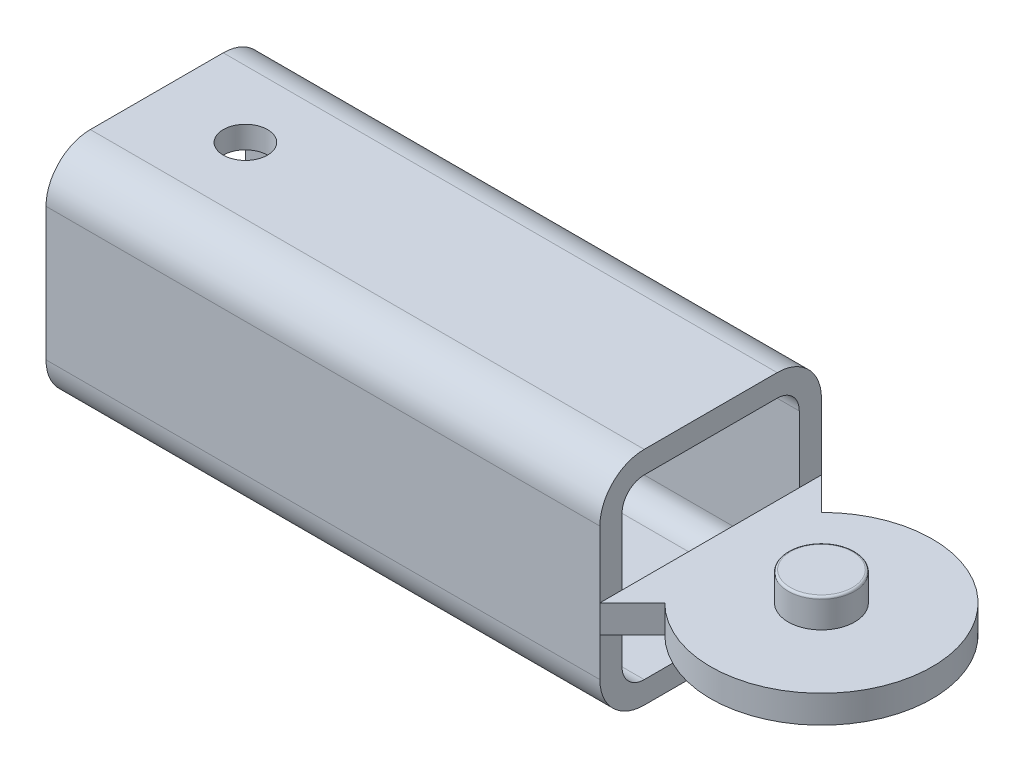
from build123d import *
from build123d.topology import SkipClean

# Parameters (mm, degrees)
SQUARE_TUBE_20_X_20_X_2_1_DEPTH = 50
SKETCH12_W                      = 20
SKETCH12_H                      = 2.5
BOSS_EXTRUDE1_DEPTH             = 20
CUT_EXTRUDE1_DEPTH              = 20
CUT_EXTRUDE2_DEPTH              = 20
SKETCH17_R                      = 3
BOSS_EXTRUDE2_DEPTH             = 2.6
FILLET2_R                       = 0.2
SKETCH18_R                      = 8
SKETCH18_R_2                    = 7
CUT_EXTRUDE4_DEPTH              = 0.2
SKETCH19_R                      = 2
CUT_EXTRUDE5_DEPTH              = 20


with BuildPart() as part:
    # Sketch11 → Square tube 20 X 20 X 2_1 (new body)
    with BuildSketch(Plane(origin=(-27.324380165, 0, 0), x_dir=(0, 0, -1), z_dir=(1, 0, 0))):
        with BuildLine():
            Line((-6, -10), (6, -10))
            ThreePointArc((6, -10), (8.828427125, -8.828427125), (10, -6))
            Line((10, -6), (10, 6))
            ThreePointArc((10, 6), (8.828427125, 8.828427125), (6, 10))
            Line((6, 10), (-6, 10))
            ThreePointArc((-6, 10), (-8.828427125, 8.828427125), (-10, 6))
            Line((-10, 6), (-10, -6))
            ThreePointArc((-10, -6), (-8.828427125, -8.828427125), (-6, -10))
        make_face()
        with BuildLine():
            Line((-6, -8), (6, -8))
            ThreePointArc((6, -8), (7.414213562, -7.414213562), (8, -6))
            Line((8, -6), (8, 6))
            ThreePointArc((8, 6), (7.414213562, 7.414213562), (6, 8))
            Line((6, 8), (-6, 8))
            ThreePointArc((-6, 8), (-7.414213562, 7.414213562), (-8, 6))
            Line((-8, 6), (-8, -6))
            ThreePointArc((-8, -6), (-7.414213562, -7.414213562), (-6, -8))
        make_face(mode=Mode.SUBTRACT)
    extrude(amount=SQUARE_TUBE_20_X_20_X_2_1_DEPTH)

    # Sketch12 → Boss-Extrude1 (add)
    with BuildSketch(Plane(origin=(22.675619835, 0, 0), x_dir=(0, 0, -1), z_dir=(1, 0, 0))):
        with Locations((0, -1.25)):
            Rectangle(SKETCH12_W, SKETCH12_H)
    extrude(amount=BOSS_EXTRUDE1_DEPTH)

    # Sketch15 → Cut-Extrude1 (cut)
    with BuildSketch(Plane(origin=(0, 0, 0), x_dir=(1, 0, 0), z_dir=(0, 1, 0))):
        with BuildLine():
            Line((42.675619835, -10), (42.675619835, 0))
            ThreePointArc((42.675619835, 0), (39.746687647, -7.071067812), (32.675619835, -10))
            Line((32.675619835, -10), (42.675619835, -10))
        make_face()
        with BuildLine():
            Line((42.675619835, 10), (32.675619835, 10))
            ThreePointArc((32.675619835, 10), (39.746687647, 7.071067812), (42.675619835, 0))
            Line((42.675619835, 0), (42.675619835, 10))
        make_face()
    extrude(amount=-CUT_EXTRUDE1_DEPTH, mode=Mode.SUBTRACT)

    # Sketch16 → Cut-Extrude2 (cut)
    with SkipClean():  # the faces are left unmerged after this step: merging them gives an invalid solid
        with BuildSketch(Plane(origin=(0, 0, 0), x_dir=(1, 0, 0), z_dir=(0, 1, 0))):
            with BuildLine():
                Line((25.604552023, 7.071067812), (22.675619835, 10))
                Line((22.675619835, 10), (32.675619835, 10))
                ThreePointArc((32.675619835, 10), (28.848785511, 9.238795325), (25.604552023, 7.071067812))
            make_face()
            with BuildLine():
                Line((25.604552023, -7.071067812), (22.675619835, -10))
                Line((22.675619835, -10), (32.675619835, -10))
                ThreePointArc((32.675619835, -10), (28.848785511, -9.238795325), (25.604552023, -7.071067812))
            make_face()
        extrude(amount=-CUT_EXTRUDE2_DEPTH, mode=Mode.SUBTRACT)

    # Sketch18 → Cut-Extrude4 (cut)
    with BuildSketch(Plane.XZ.offset(2.5)):
        with Locations(Location((32.675619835, 0, 0), (0, 0, 270))):
            Circle(SKETCH18_R)
        with Locations(Location((32.675619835, 0, 0), (0, 0, 270))):
            Circle(SKETCH18_R_2, mode=Mode.SUBTRACT)
    extrude(amount=-CUT_EXTRUDE4_DEPTH, mode=Mode.SUBTRACT)

    # Sketch19 → Cut-Extrude5 (cut)
    with BuildSketch(Plane.XZ.offset(10)):
        with Locations(Location((-19.324380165, 0, 0), (0, 0, 270))):
            Circle(SKETCH19_R)
    extrude(amount=-CUT_EXTRUDE5_DEPTH, mode=Mode.SUBTRACT)


with BuildPart() as body_2:
    # Sketch17 → Boss-Extrude2 (new body)
    with BuildSketch(Plane(origin=(0, 0, 0), x_dir=(1, 0, 0), z_dir=(0, 1, 0))):
        with Locations(Location((32.675619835, 0, 0), (0, 0, 270))):
            Circle(SKETCH17_R)
    extrude(amount=BOSS_EXTRUDE2_DEPTH)

    # Fillet2
    fillet2_edges = [body_2.edges().sort_by_distance(p)[0] for p in [
        (32.675619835, 2.6, -3),
    ]]
    fillet(fillet2_edges, radius=FILLET2_R)


solid = Compound([part.part, body_2.part])
